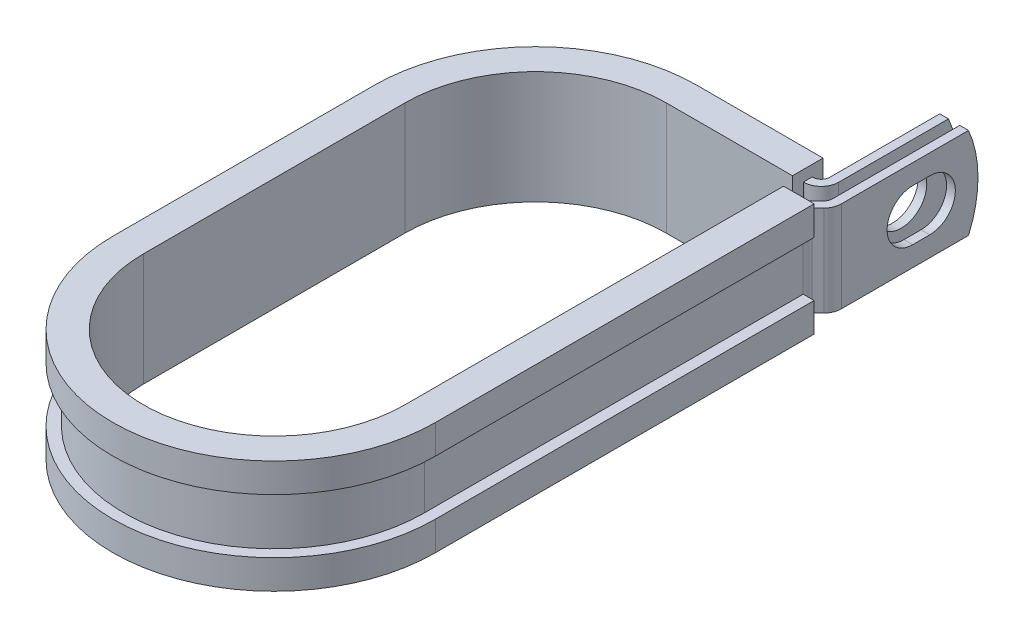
from build123d import *

# Parameters (mm, degrees)
EXTRUDE_THIN1_DEPTH = 6.35
SKETCH2_R           = 3.5687
CUT_EXTRUDE1_DEPTH  = 1.2192
CUT_EXTRUDE2_DEPTH  = 1.2192
CUT_EXTRUDE3_DEPTH  = 71.252476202


with BuildPart() as part:
    # Sketch1 → Extrude-Thin1 (new, symmetric)
    with BuildSketch(Plane(origin=(0, 0, 0), x_dir=(1, 0, 0), z_dir=(0, 1, 0))):
        with BuildLine():
            Line((21.6713698, 38.862), (21.6713698, 19.7739))
            ThreePointArc((21.6713698, 19.7739), (21.578563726, 19.307332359), (21.314274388, 18.911795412))
            Line((21.314274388, 18.911795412), (20.488090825, 18.085611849))
            ThreePointArc((20.488090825, 18.085611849), (19.959512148, 17.294537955), (19.7739, 16.361402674))
            Line((19.7739, 16.361402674), (19.7739, 0))
            Line((19.7739, 0), (19.7739, -36.4998))
            ThreePointArc((19.7739, -36.4998), (0, -56.2737), (-19.7739, -36.4998))
            Line((-19.7739, -36.4998), (-19.7739, 0))
            ThreePointArc((-19.7739, 0), (-13.982258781, 13.982258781), (0, 19.7739))
            Line((0, 19.7739), (17.6581698, 19.7739))
            ThreePointArc((17.6581698, 19.7739), (19.382378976, 20.488090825), (20.0965698, 22.2123))
            Line((20.0965698, 22.2123), (20.0965698, 38.862))
            Line((20.0965698, 38.862), (18.8773698, 38.862))
            Line((18.8773698, 38.862), (18.8773698, 22.2123))
            ThreePointArc((18.8773698, 22.2123), (18.520274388, 21.350195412), (17.6581698, 20.9931))
            Line((17.6581698, 20.9931), (0, 20.9931))
            ThreePointArc((0, 20.9931), (-14.844363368, 14.844363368), (-20.9931, 0))
            Line((-20.9931, 0), (-20.9931, -36.4998))
            ThreePointArc((-20.9931, -36.4998), (0, -57.4929), (20.9931, -36.4998))
            Line((20.9931, -36.4998), (20.9931, 0))
            Line((20.9931, 0), (20.9931, 16.361402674))
            ThreePointArc((20.9931, 16.361402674), (21.085906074, 16.827970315), (21.350195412, 17.223507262))
            Line((21.350195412, 17.223507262), (22.176378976, 18.049690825))
            ThreePointArc((22.176378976, 18.049690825), (22.704957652, 18.840764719), (22.8905698, 19.7739))
            Line((22.8905698, 19.7739), (22.8905698, 38.862))
            Line((22.8905698, 38.862), (21.6713698, 38.862))
        make_face()
    extrude(amount=EXTRUDE_THIN1_DEPTH, both=True)

    # Sketch2 → Cut-Extrude1 (cut)
    with BuildSketch(Plane.ZY.offset(-18.8773698)):
        with Locations((-30.9372, 0)):
            Circle(SKETCH2_R)
    extrude(amount=-CUT_EXTRUDE1_DEPTH, mode=Mode.SUBTRACT)

    # Sketch3 → Cut-Extrude2 (cut)
    with BuildSketch(Plane(origin=(22.8905698, 0, 0), x_dir=(0, 0, -1), z_dir=(1, 0, 0))):
        with BuildLine():
            Line((29.7434, 3.5687), (32.131, 3.5687))
            ThreePointArc((32.131, 3.5687), (35.6997, 0), (32.131, -3.5687))
            Line((32.131, -3.5687), (29.7434, -3.5687))
            ThreePointArc((29.7434, -3.5687), (26.1747, 0), (29.7434, 3.5687))
        make_face()
    extrude(amount=-CUT_EXTRUDE2_DEPTH, mode=Mode.SUBTRACT)

    # Sketch4 → Cut-Extrude3 (cut, through all)
    with BuildSketch(Plane.ZY.offset(-18.8773698)):
        with BuildLine():
            Line((-37.536677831, 6.35), (-38.862, 6.35))
            Line((-38.862, 6.35), (-38.862, 0))
            ThreePointArc((-38.862, 0), (-38.527137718, 3.243415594), (-37.536677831, 6.35))
        make_face()
        with BuildLine():
            ThreePointArc((-37.536677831, -6.35), (-38.527137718, -3.243415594), (-38.862, 0))
            Line((-38.862, 0), (-38.862, -6.35))
            Line((-38.862, -6.35), (-37.536677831, -6.35))
        make_face()
    extrude(amount=-CUT_EXTRUDE3_DEPTH, mode=Mode.SUBTRACT)

    # Sweep1: sweep along a path in Sketch6
    with BuildLine(Plane(origin=(0, 6.35, 0), x_dir=(1, 0, 0), z_dir=(0, 1, 0))) as sweep1_path:
        Line((18.2499, 16.361402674), (18.2499, 0))
        Line((18.2499, 0), (18.2499, -36.4998))
        ThreePointArc((18.2499, -36.4998), (0, -54.7497), (-18.2499, -36.4998))
        Line((-18.2499, -36.4998), (-18.2499, 0))
        ThreePointArc((-18.2499, 0), (-12.904628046, 12.904628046), (0, 18.2499))
        Line((0, 18.2499), (17.6073698, 18.2499))
    # Sketch5 → Sweep1 (sweep)
    with BuildSketch(Plane(origin=(0, 0, -16.361402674), x_dir=(-1, 0, 0), z_dir=(0, 0, -1))):
        Polygon((-20.9931, 6.35), (-19.7739, 6.35), (-19.7739, -6.35), (-20.9931, -6.35), (-20.9931, -3.81), (-22.5171, -3.81), (-22.5171, -7.874), (-18.2499, -7.874), (-18.2499, 7.874), (-22.5171, 7.874), (-22.5171, 3.81), (-20.9931, 3.81), align=None)
    sweep(path=sweep1_path.line)


solid = part.part
